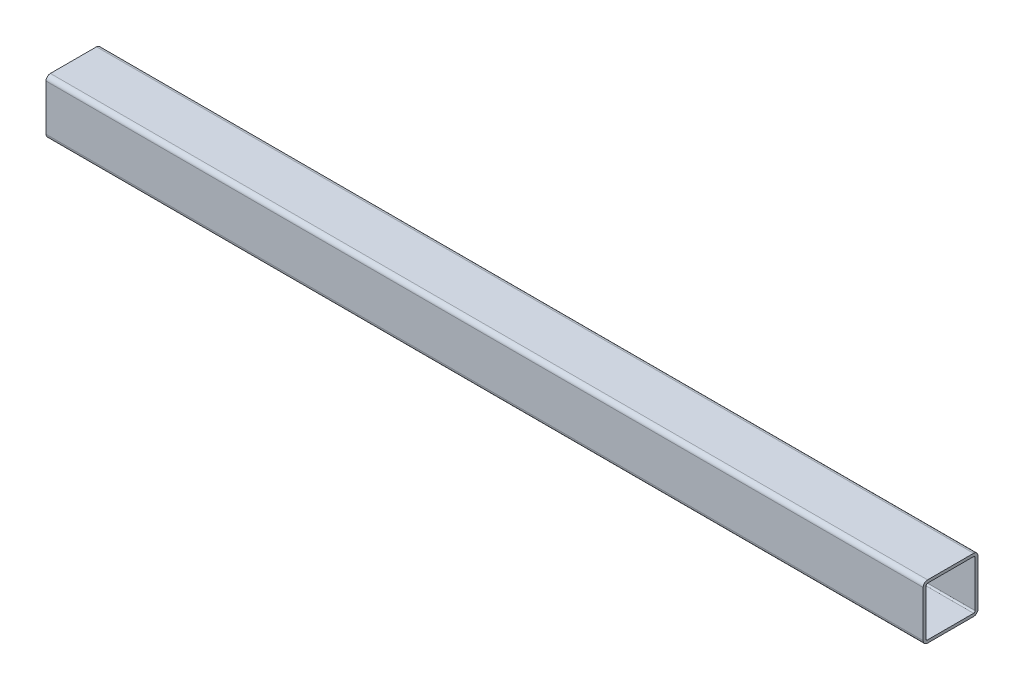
ISO-10303-21;
HEADER;
FILE_DESCRIPTION(('STEP AP214'),'2;1');
FILE_NAME('part.step','',(''),(''),'','','');
FILE_SCHEMA(('AUTOMOTIVE_DESIGN { 1 0 10303 214 1 1 1 1 }'));
ENDSEC;
DATA;
#1=APPLICATION_CONTEXT('core data for automotive mechanical design processes');
#2=APPLICATION_PROTOCOL_DEFINITION('international standard','automotive_design',2000,#1);
#3=PRODUCT_CONTEXT('',#1,'mechanical');
#4=PRODUCT('Part','Part','',(#3));
#5=PRODUCT_RELATED_PRODUCT_CATEGORY('part','',(#4));
#6=PRODUCT_DEFINITION_FORMATION('','',#4);
#7=PRODUCT_DEFINITION_CONTEXT('part definition',#1,'design');
#8=PRODUCT_DEFINITION('design','',#6,#7);
#9=PRODUCT_DEFINITION_SHAPE('','',#8);
#10=(LENGTH_UNIT() NAMED_UNIT(*) SI_UNIT(.MILLI.,.METRE.));
#11=(NAMED_UNIT(*) PLANE_ANGLE_UNIT() SI_UNIT($,.RADIAN.));
#12=(NAMED_UNIT(*) SI_UNIT($,.STERADIAN.) SOLID_ANGLE_UNIT());
#13=UNCERTAINTY_MEASURE_WITH_UNIT(LENGTH_MEASURE(1.E-05),#10,'distance_accuracy_value','');
#14=(GEOMETRIC_REPRESENTATION_CONTEXT(3) GLOBAL_UNCERTAINTY_ASSIGNED_CONTEXT((#13)) GLOBAL_UNIT_ASSIGNED_CONTEXT((#10,
#11,#12)) REPRESENTATION_CONTEXT('',''));
#15=CARTESIAN_POINT('',(0.,0.,0.));
#16=DIRECTION('',(0.,0.,1.));
#17=DIRECTION('',(1.,0.,0.));
#18=AXIS2_PLACEMENT_3D('',#15,#16,#17);
#19=CARTESIAN_POINT('',(203.2,10.541,21.209));
#20=DIRECTION('',(1.,0.,0.));
#21=DIRECTION('',(0.,0.,-1.));
#22=AXIS2_PLACEMENT_3D('',#19,#20,#21);
#23=PLANE('',#22);
#24=CARTESIAN_POINT('',(203.2,10.541,21.209));
#25=DIRECTION('',(1.,0.,0.));
#26=DIRECTION('',(0.,0.,-1.));
#27=AXIS2_PLACEMENT_3D('',#24,#25,#26);
#28=CIRCLE('',#27,1.01599999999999);
#29=CARTESIAN_POINT('',(203.2,10.541,22.225));
#30=VERTEX_POINT('',#29);
#31=CARTESIAN_POINT('',(203.2,9.525,21.209));
#32=VERTEX_POINT('',#31);
#33=EDGE_CURVE('E260',#30,#32,#28,.T.);
#34=ORIENTED_EDGE('',*,*,#33,.T.);
#35=DIRECTION('',(0.,0.,-1.));
#36=VECTOR('',#35,1.);
#37=CARTESIAN_POINT('',(203.2,9.525,21.209));
#38=LINE('',#37,#36);
#39=CARTESIAN_POINT('',(203.2,9.525,10.541));
#40=VERTEX_POINT('',#39);
#41=EDGE_CURVE('E474',#32,#40,#38,.T.);
#42=ORIENTED_EDGE('',*,*,#41,.T.);
#43=CARTESIAN_POINT('',(203.2,10.541,10.541));
#44=DIRECTION('',(1.,0.,0.));
#45=DIRECTION('',(0.,0.,-1.));
#46=AXIS2_PLACEMENT_3D('',#43,#44,#45);
#47=CIRCLE('',#46,1.016);
#48=CARTESIAN_POINT('',(203.2,10.541,9.52499999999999));
#49=VERTEX_POINT('',#48);
#50=EDGE_CURVE('E161',#40,#49,#47,.T.);
#51=ORIENTED_EDGE('',*,*,#50,.T.);
#52=DIRECTION('',(0.,1.,0.));
#53=VECTOR('',#52,1.);
#54=CARTESIAN_POINT('',(203.2,10.541,9.52499999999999));
#55=LINE('',#54,#53);
#56=CARTESIAN_POINT('',(203.2,21.209,9.52499999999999));
#57=VERTEX_POINT('',#56);
#58=EDGE_CURVE('E460',#49,#57,#55,.T.);
#59=ORIENTED_EDGE('',*,*,#58,.T.);
#60=CARTESIAN_POINT('',(203.2,21.209,10.541));
#61=DIRECTION('',(1.,0.,0.));
#62=DIRECTION('',(0.,0.,-1.));
#63=AXIS2_PLACEMENT_3D('',#60,#61,#62);
#64=CIRCLE('',#63,1.016);
#65=CARTESIAN_POINT('',(203.2,22.225,10.541));
#66=VERTEX_POINT('',#65);
#67=EDGE_CURVE('E469',#57,#66,#64,.T.);
#68=ORIENTED_EDGE('',*,*,#67,.T.);
#69=DIRECTION('',(0.,0.,1.));
#70=VECTOR('',#69,1.);
#71=CARTESIAN_POINT('',(203.2,22.225,10.541));
#72=LINE('',#71,#70);
#73=CARTESIAN_POINT('',(203.2,22.225,21.209));
#74=VERTEX_POINT('',#73);
#75=EDGE_CURVE('E276',#66,#74,#72,.T.);
#76=ORIENTED_EDGE('',*,*,#75,.T.);
#77=CARTESIAN_POINT('',(203.2,21.209,21.209));
#78=DIRECTION('',(1.,0.,0.));
#79=DIRECTION('',(0.,0.,-1.));
#80=AXIS2_PLACEMENT_3D('',#77,#78,#79);
#81=CIRCLE('',#80,1.016);
#82=CARTESIAN_POINT('',(203.2,21.209,22.225));
#83=VERTEX_POINT('',#82);
#84=EDGE_CURVE('E293',#74,#83,#81,.T.);
#85=ORIENTED_EDGE('',*,*,#84,.T.);
#86=DIRECTION('',(0.,-1.,0.));
#87=VECTOR('',#86,1.);
#88=CARTESIAN_POINT('',(203.2,21.209,22.225));
#89=LINE('',#88,#87);
#90=EDGE_CURVE('E257',#83,#30,#89,.T.);
#91=ORIENTED_EDGE('',*,*,#90,.T.);
#92=EDGE_LOOP('',(#34,#42,#51,#59,#68,#76,#85,#91));
#93=FACE_BOUND('',#92,.T.);
#94=DIRECTION('',(0.,1.,0.));
#95=VECTOR('',#94,1.);
#96=CARTESIAN_POINT('',(203.2,10.541,10.1854));
#97=LINE('',#96,#95);
#98=CARTESIAN_POINT('',(203.2,10.541,10.1854));
#99=VERTEX_POINT('',#98);
#100=CARTESIAN_POINT('',(203.2,21.209,10.1854));
#101=VERTEX_POINT('',#100);
#102=EDGE_CURVE('E253',#99,#101,#97,.T.);
#103=ORIENTED_EDGE('',*,*,#102,.F.);
#104=CARTESIAN_POINT('',(203.2,10.541,10.541));
#105=DIRECTION('',(1.,0.,0.));
#106=DIRECTION('',(0.,0.,-1.));
#107=AXIS2_PLACEMENT_3D('',#104,#105,#106);
#108=CIRCLE('',#107,0.355599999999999);
#109=CARTESIAN_POINT('',(203.2,10.1854,10.541));
#110=VERTEX_POINT('',#109);
#111=EDGE_CURVE('E100',#110,#99,#108,.T.);
#112=ORIENTED_EDGE('',*,*,#111,.F.);
#113=DIRECTION('',(0.,0.,-1.));
#114=VECTOR('',#113,1.);
#115=CARTESIAN_POINT('',(203.2,10.1854,21.209));
#116=LINE('',#115,#114);
#117=CARTESIAN_POINT('',(203.2,10.1854,21.209));
#118=VERTEX_POINT('',#117);
#119=EDGE_CURVE('E212',#118,#110,#116,.T.);
#120=ORIENTED_EDGE('',*,*,#119,.F.);
#121=CARTESIAN_POINT('',(203.2,10.541,21.209));
#122=DIRECTION('',(1.,1.3324446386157E-13,-1.33244463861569E-13));
#123=DIRECTION('',(-1.3324446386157E-13,1.,0.));
#124=AXIS2_PLACEMENT_3D('',#121,#122,#123);
#125=CIRCLE('',#124,0.355600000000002);
#126=CARTESIAN_POINT('',(203.2,10.541,21.5646));
#127=VERTEX_POINT('',#126);
#128=EDGE_CURVE('E243',#127,#118,#125,.T.);
#129=ORIENTED_EDGE('',*,*,#128,.F.);
#130=DIRECTION('',(0.,-1.,0.));
#131=VECTOR('',#130,1.);
#132=CARTESIAN_POINT('',(203.2,21.209,21.5646));
#133=LINE('',#132,#131);
#134=CARTESIAN_POINT('',(203.2,21.209,21.5646));
#135=VERTEX_POINT('',#134);
#136=EDGE_CURVE('E229',#135,#127,#133,.T.);
#137=ORIENTED_EDGE('',*,*,#136,.F.);
#138=CARTESIAN_POINT('',(203.2,21.209,21.209));
#139=DIRECTION('',(1.,0.,0.));
#140=DIRECTION('',(0.,0.,-1.));
#141=AXIS2_PLACEMENT_3D('',#138,#139,#140);
#142=CIRCLE('',#141,0.355600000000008);
#143=CARTESIAN_POINT('',(203.2,21.5646,21.209));
#144=VERTEX_POINT('',#143);
#145=EDGE_CURVE('E238',#144,#135,#142,.T.);
#146=ORIENTED_EDGE('',*,*,#145,.F.);
#147=DIRECTION('',(0.,0.,1.));
#148=VECTOR('',#147,1.);
#149=CARTESIAN_POINT('',(203.2,21.5646,10.541));
#150=LINE('',#149,#148);
#151=CARTESIAN_POINT('',(203.2,21.5646,10.541));
#152=VERTEX_POINT('',#151);
#153=EDGE_CURVE('E246',#152,#144,#150,.T.);
#154=ORIENTED_EDGE('',*,*,#153,.F.);
#155=CARTESIAN_POINT('',(203.2,21.209,10.541));
#156=DIRECTION('',(1.,1.33244463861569E-13,-1.33244463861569E-13));
#157=DIRECTION('',(-1.33244463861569E-13,0.,-1.));
#158=AXIS2_PLACEMENT_3D('',#155,#156,#157);
#159=CIRCLE('',#158,0.355599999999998);
#160=EDGE_CURVE('E251',#101,#152,#159,.T.);
#161=ORIENTED_EDGE('',*,*,#160,.F.);
#162=EDGE_LOOP('',(#103,#112,#120,#129,#137,#146,#154,#161));
#163=FACE_BOUND('',#162,.T.);
#164=ADVANCED_FACE('F41',(#93,#163),#23,.T.);
#165=CARTESIAN_POINT('',(0.,10.541,21.209));
#166=DIRECTION('',(1.,0.,0.));
#167=DIRECTION('',(0.,0.,-1.));
#168=AXIS2_PLACEMENT_3D('',#165,#166,#167);
#169=PLANE('',#168);
#170=CARTESIAN_POINT('',(0.,10.541,21.209));
#171=DIRECTION('',(1.,0.,0.));
#172=DIRECTION('',(0.,0.,-1.));
#173=AXIS2_PLACEMENT_3D('',#170,#171,#172);
#174=CIRCLE('',#173,1.01599999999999);
#175=CARTESIAN_POINT('',(0.,10.541,22.225));
#176=VERTEX_POINT('',#175);
#177=CARTESIAN_POINT('',(0.,9.525,21.209));
#178=VERTEX_POINT('',#177);
#179=EDGE_CURVE('E154',#176,#178,#174,.T.);
#180=ORIENTED_EDGE('',*,*,#179,.F.);
#181=DIRECTION('',(0.,-1.,0.));
#182=VECTOR('',#181,1.);
#183=CARTESIAN_POINT('',(0.,21.209,22.225));
#184=LINE('',#183,#182);
#185=CARTESIAN_POINT('',(0.,21.209,22.225));
#186=VERTEX_POINT('',#185);
#187=EDGE_CURVE('E258',#186,#176,#184,.T.);
#188=ORIENTED_EDGE('',*,*,#187,.F.);
#189=CARTESIAN_POINT('',(0.,21.209,21.209));
#190=DIRECTION('',(1.,0.,0.));
#191=DIRECTION('',(0.,0.,-1.));
#192=AXIS2_PLACEMENT_3D('',#189,#190,#191);
#193=CIRCLE('',#192,1.016);
#194=CARTESIAN_POINT('',(0.,22.225,21.209));
#195=VERTEX_POINT('',#194);
#196=EDGE_CURVE('E261',#195,#186,#193,.T.);
#197=ORIENTED_EDGE('',*,*,#196,.F.);
#198=DIRECTION('',(0.,0.,1.));
#199=VECTOR('',#198,1.);
#200=CARTESIAN_POINT('',(0.,22.225,10.541));
#201=LINE('',#200,#199);
#202=CARTESIAN_POINT('',(0.,22.225,10.541));
#203=VERTEX_POINT('',#202);
#204=EDGE_CURVE('E263',#203,#195,#201,.T.);
#205=ORIENTED_EDGE('',*,*,#204,.F.);
#206=CARTESIAN_POINT('',(0.,21.209,10.541));
#207=DIRECTION('',(1.,0.,0.));
#208=DIRECTION('',(0.,0.,-1.));
#209=AXIS2_PLACEMENT_3D('',#206,#207,#208);
#210=CIRCLE('',#209,1.016);
#211=CARTESIAN_POINT('',(0.,21.209,9.52499999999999));
#212=VERTEX_POINT('',#211);
#213=EDGE_CURVE('E170',#212,#203,#210,.T.);
#214=ORIENTED_EDGE('',*,*,#213,.F.);
#215=DIRECTION('',(0.,1.,0.));
#216=VECTOR('',#215,1.);
#217=CARTESIAN_POINT('',(0.,10.541,9.52499999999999));
#218=LINE('',#217,#216);
#219=CARTESIAN_POINT('',(0.,10.541,9.52499999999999));
#220=VERTEX_POINT('',#219);
#221=EDGE_CURVE('E168',#220,#212,#218,.T.);
#222=ORIENTED_EDGE('',*,*,#221,.F.);
#223=CARTESIAN_POINT('',(0.,10.541,10.541));
#224=DIRECTION('',(1.,0.,0.));
#225=DIRECTION('',(0.,0.,-1.));
#226=AXIS2_PLACEMENT_3D('',#223,#224,#225);
#227=CIRCLE('',#226,1.016);
#228=CARTESIAN_POINT('',(0.,9.525,10.541));
#229=VERTEX_POINT('',#228);
#230=EDGE_CURVE('E153',#229,#220,#227,.T.);
#231=ORIENTED_EDGE('',*,*,#230,.F.);
#232=DIRECTION('',(0.,0.,-1.));
#233=VECTOR('',#232,1.);
#234=CARTESIAN_POINT('',(0.,9.525,21.209));
#235=LINE('',#234,#233);
#236=EDGE_CURVE('E143',#178,#229,#235,.T.);
#237=ORIENTED_EDGE('',*,*,#236,.F.);
#238=EDGE_LOOP('',(#180,#188,#197,#205,#214,#222,#231,#237));
#239=FACE_BOUND('',#238,.T.);
#240=CARTESIAN_POINT('',(0.,10.541,10.541));
#241=DIRECTION('',(1.,0.,0.));
#242=DIRECTION('',(0.,0.,-1.));
#243=AXIS2_PLACEMENT_3D('',#240,#241,#242);
#244=CIRCLE('',#243,0.355599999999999);
#245=CARTESIAN_POINT('',(0.,10.1854,10.541));
#246=VERTEX_POINT('',#245);
#247=CARTESIAN_POINT('',(0.,10.541,10.1854));
#248=VERTEX_POINT('',#247);
#249=EDGE_CURVE('E66',#246,#248,#244,.T.);
#250=ORIENTED_EDGE('',*,*,#249,.T.);
#251=DIRECTION('',(0.,1.,0.));
#252=VECTOR('',#251,1.);
#253=CARTESIAN_POINT('',(0.,10.541,10.1854));
#254=LINE('',#253,#252);
#255=CARTESIAN_POINT('',(0.,21.209,10.1854));
#256=VERTEX_POINT('',#255);
#257=EDGE_CURVE('E175',#248,#256,#254,.T.);
#258=ORIENTED_EDGE('',*,*,#257,.T.);
#259=CARTESIAN_POINT('',(0.,21.209,10.541));
#260=DIRECTION('',(1.,0.,0.));
#261=DIRECTION('',(0.,0.,-1.));
#262=AXIS2_PLACEMENT_3D('',#259,#260,#261);
#263=CIRCLE('',#262,0.355599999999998);
#264=CARTESIAN_POINT('',(0.,21.5646,10.541));
#265=VERTEX_POINT('',#264);
#266=EDGE_CURVE('E178',#256,#265,#263,.T.);
#267=ORIENTED_EDGE('',*,*,#266,.T.);
#268=DIRECTION('',(0.,0.,1.));
#269=VECTOR('',#268,1.);
#270=CARTESIAN_POINT('',(0.,21.5646,10.541));
#271=LINE('',#270,#269);
#272=CARTESIAN_POINT('',(0.,21.5646,21.209));
#273=VERTEX_POINT('',#272);
#274=EDGE_CURVE('E181',#265,#273,#271,.T.);
#275=ORIENTED_EDGE('',*,*,#274,.T.);
#276=CARTESIAN_POINT('',(0.,21.209,21.209));
#277=DIRECTION('',(1.,0.,0.));
#278=DIRECTION('',(0.,0.,-1.));
#279=AXIS2_PLACEMENT_3D('',#276,#277,#278);
#280=CIRCLE('',#279,0.355600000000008);
#281=CARTESIAN_POINT('',(0.,21.209,21.5646));
#282=VERTEX_POINT('',#281);
#283=EDGE_CURVE('E184',#273,#282,#280,.T.);
#284=ORIENTED_EDGE('',*,*,#283,.T.);
#285=DIRECTION('',(0.,-1.,0.));
#286=VECTOR('',#285,1.);
#287=CARTESIAN_POINT('',(0.,21.209,21.5646));
#288=LINE('',#287,#286);
#289=CARTESIAN_POINT('',(0.,10.541,21.5646));
#290=VERTEX_POINT('',#289);
#291=EDGE_CURVE('E187',#282,#290,#288,.T.);
#292=ORIENTED_EDGE('',*,*,#291,.T.);
#293=CARTESIAN_POINT('',(0.,10.541,21.209));
#294=DIRECTION('',(1.,0.,0.));
#295=DIRECTION('',(0.,0.,-1.));
#296=AXIS2_PLACEMENT_3D('',#293,#294,#295);
#297=CIRCLE('',#296,0.355600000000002);
#298=CARTESIAN_POINT('',(0.,10.1854,21.209));
#299=VERTEX_POINT('',#298);
#300=EDGE_CURVE('E190',#290,#299,#297,.T.);
#301=ORIENTED_EDGE('',*,*,#300,.T.);
#302=DIRECTION('',(0.,0.,-1.));
#303=VECTOR('',#302,1.);
#304=CARTESIAN_POINT('',(0.,10.1854,21.209));
#305=LINE('',#304,#303);
#306=EDGE_CURVE('E193',#299,#246,#305,.T.);
#307=ORIENTED_EDGE('',*,*,#306,.T.);
#308=EDGE_LOOP('',(#250,#258,#267,#275,#284,#292,#301,#307));
#309=FACE_BOUND('',#308,.T.);
#310=ADVANCED_FACE('F165',(#239,#309),#169,.F.);
#311=CARTESIAN_POINT('',(203.2,10.541,21.209));
#312=DIRECTION('',(-1.,0.,0.));
#313=DIRECTION('',(0.,0.,1.));
#314=AXIS2_PLACEMENT_3D('',#311,#312,#313);
#315=CYLINDRICAL_SURFACE('',#314,1.016);
#316=ORIENTED_EDGE('',*,*,#179,.T.);
#317=DIRECTION('',(-1.,0.,0.));
#318=VECTOR('',#317,1.);
#319=CARTESIAN_POINT('',(203.2,9.525,21.209));
#320=LINE('',#319,#318);
#321=EDGE_CURVE('E11',#32,#178,#320,.T.);
#322=ORIENTED_EDGE('',*,*,#321,.F.);
#323=ORIENTED_EDGE('',*,*,#33,.F.);
#324=DIRECTION('',(-1.,0.,0.));
#325=VECTOR('',#324,1.);
#326=CARTESIAN_POINT('',(203.2,10.541,22.225));
#327=LINE('',#326,#325);
#328=EDGE_CURVE('E209',#30,#176,#327,.T.);
#329=ORIENTED_EDGE('',*,*,#328,.T.);
#330=EDGE_LOOP('',(#316,#322,#323,#329));
#331=FACE_BOUND('',#330,.T.);
#332=ADVANCED_FACE('F323',(#331),#315,.T.);
#333=CARTESIAN_POINT('',(203.2,9.525,21.209));
#334=DIRECTION('',(0.,1.,0.));
#335=DIRECTION('',(0.,0.,1.));
#336=AXIS2_PLACEMENT_3D('',#333,#334,#335);
#337=PLANE('',#336);
#338=ORIENTED_EDGE('',*,*,#236,.T.);
#339=DIRECTION('',(-1.,0.,0.));
#340=VECTOR('',#339,1.);
#341=CARTESIAN_POINT('',(203.2,9.525,10.541));
#342=LINE('',#341,#340);
#343=EDGE_CURVE('E50',#40,#229,#342,.T.);
#344=ORIENTED_EDGE('',*,*,#343,.F.);
#345=ORIENTED_EDGE('',*,*,#41,.F.);
#346=ORIENTED_EDGE('',*,*,#321,.T.);
#347=EDGE_LOOP('',(#338,#344,#345,#346));
#348=FACE_BOUND('',#347,.T.);
#349=ADVANCED_FACE('F147',(#348),#337,.F.);
#350=CARTESIAN_POINT('',(203.2,10.541,10.541));
#351=DIRECTION('',(-1.,0.,0.));
#352=DIRECTION('',(0.,0.,1.));
#353=AXIS2_PLACEMENT_3D('',#350,#351,#352);
#354=CYLINDRICAL_SURFACE('',#353,1.016);
#355=ORIENTED_EDGE('',*,*,#230,.T.);
#356=DIRECTION('',(-1.,0.,0.));
#357=VECTOR('',#356,1.);
#358=CARTESIAN_POINT('',(203.2,10.541,9.52499999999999));
#359=LINE('',#358,#357);
#360=EDGE_CURVE('E162',#49,#220,#359,.T.);
#361=ORIENTED_EDGE('',*,*,#360,.F.);
#362=ORIENTED_EDGE('',*,*,#50,.F.);
#363=ORIENTED_EDGE('',*,*,#343,.T.);
#364=EDGE_LOOP('',(#355,#361,#362,#363));
#365=FACE_BOUND('',#364,.T.);
#366=ADVANCED_FACE('F157',(#365),#354,.T.);
#367=CARTESIAN_POINT('',(203.2,10.541,9.52499999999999));
#368=DIRECTION('',(0.,0.,1.));
#369=DIRECTION('',(1.,0.,0.));
#370=AXIS2_PLACEMENT_3D('',#367,#368,#369);
#371=PLANE('',#370);
#372=ORIENTED_EDGE('',*,*,#221,.T.);
#373=DIRECTION('',(-1.,0.,0.));
#374=VECTOR('',#373,1.);
#375=CARTESIAN_POINT('',(203.2,21.209,9.52499999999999));
#376=LINE('',#375,#374);
#377=EDGE_CURVE('E197',#57,#212,#376,.T.);
#378=ORIENTED_EDGE('',*,*,#377,.F.);
#379=ORIENTED_EDGE('',*,*,#58,.F.);
#380=ORIENTED_EDGE('',*,*,#360,.T.);
#381=EDGE_LOOP('',(#372,#378,#379,#380));
#382=FACE_BOUND('',#381,.T.);
#383=ADVANCED_FACE('F333',(#382),#371,.F.);
#384=CARTESIAN_POINT('',(203.2,21.209,10.541));
#385=DIRECTION('',(-1.,0.,0.));
#386=DIRECTION('',(0.,0.,1.));
#387=AXIS2_PLACEMENT_3D('',#384,#385,#386);
#388=CYLINDRICAL_SURFACE('',#387,1.016);
#389=ORIENTED_EDGE('',*,*,#213,.T.);
#390=DIRECTION('',(-1.,0.,0.));
#391=VECTOR('',#390,1.);
#392=CARTESIAN_POINT('',(203.2,22.225,10.541));
#393=LINE('',#392,#391);
#394=EDGE_CURVE('E200',#66,#203,#393,.T.);
#395=ORIENTED_EDGE('',*,*,#394,.F.);
#396=ORIENTED_EDGE('',*,*,#67,.F.);
#397=ORIENTED_EDGE('',*,*,#377,.T.);
#398=EDGE_LOOP('',(#389,#395,#396,#397));
#399=FACE_BOUND('',#398,.T.);
#400=ADVANCED_FACE('F266',(#399),#388,.T.);
#401=CARTESIAN_POINT('',(203.2,22.225,10.541));
#402=DIRECTION('',(0.,-1.,0.));
#403=DIRECTION('',(0.,0.,-1.));
#404=AXIS2_PLACEMENT_3D('',#401,#402,#403);
#405=PLANE('',#404);
#406=ORIENTED_EDGE('',*,*,#204,.T.);
#407=DIRECTION('',(-1.,0.,0.));
#408=VECTOR('',#407,1.);
#409=CARTESIAN_POINT('',(203.2,22.225,21.209));
#410=LINE('',#409,#408);
#411=EDGE_CURVE('E203',#74,#195,#410,.T.);
#412=ORIENTED_EDGE('',*,*,#411,.F.);
#413=ORIENTED_EDGE('',*,*,#75,.F.);
#414=ORIENTED_EDGE('',*,*,#394,.T.);
#415=EDGE_LOOP('',(#406,#412,#413,#414));
#416=FACE_BOUND('',#415,.T.);
#417=ADVANCED_FACE('F273',(#416),#405,.F.);
#418=CARTESIAN_POINT('',(203.2,21.209,21.209));
#419=DIRECTION('',(-1.,0.,0.));
#420=DIRECTION('',(0.,0.,1.));
#421=AXIS2_PLACEMENT_3D('',#418,#419,#420);
#422=CYLINDRICAL_SURFACE('',#421,1.016);
#423=ORIENTED_EDGE('',*,*,#196,.T.);
#424=DIRECTION('',(-1.,0.,0.));
#425=VECTOR('',#424,1.);
#426=CARTESIAN_POINT('',(203.2,21.209,22.225));
#427=LINE('',#426,#425);
#428=EDGE_CURVE('E206',#83,#186,#427,.T.);
#429=ORIENTED_EDGE('',*,*,#428,.F.);
#430=ORIENTED_EDGE('',*,*,#84,.F.);
#431=ORIENTED_EDGE('',*,*,#411,.T.);
#432=EDGE_LOOP('',(#423,#429,#430,#431));
#433=FACE_BOUND('',#432,.T.);
#434=ADVANCED_FACE('F281',(#433),#422,.T.);
#435=CARTESIAN_POINT('',(203.2,21.209,22.225));
#436=DIRECTION('',(0.,0.,-1.));
#437=DIRECTION('',(0.,1.,0.));
#438=AXIS2_PLACEMENT_3D('',#435,#436,#437);
#439=PLANE('',#438);
#440=ORIENTED_EDGE('',*,*,#187,.T.);
#441=ORIENTED_EDGE('',*,*,#328,.F.);
#442=ORIENTED_EDGE('',*,*,#90,.F.);
#443=ORIENTED_EDGE('',*,*,#428,.T.);
#444=EDGE_LOOP('',(#440,#441,#442,#443));
#445=FACE_BOUND('',#444,.T.);
#446=ADVANCED_FACE('F285',(#445),#439,.F.);
#447=CARTESIAN_POINT('',(203.2,10.541,10.541));
#448=DIRECTION('',(-1.,0.,0.));
#449=DIRECTION('',(0.,0.,1.));
#450=AXIS2_PLACEMENT_3D('',#447,#448,#449);
#451=CYLINDRICAL_SURFACE('',#450,0.3556);
#452=ORIENTED_EDGE('',*,*,#249,.F.);
#453=DIRECTION('',(-1.,0.,0.));
#454=VECTOR('',#453,1.);
#455=CARTESIAN_POINT('',(203.2,10.1854,10.541));
#456=LINE('',#455,#454);
#457=EDGE_CURVE('E210',#110,#246,#456,.T.);
#458=ORIENTED_EDGE('',*,*,#457,.F.);
#459=ORIENTED_EDGE('',*,*,#111,.T.);
#460=DIRECTION('',(-1.,0.,0.));
#461=VECTOR('',#460,1.);
#462=CARTESIAN_POINT('',(203.2,10.541,10.1854));
#463=LINE('',#462,#461);
#464=EDGE_CURVE('E213',#99,#248,#463,.T.);
#465=ORIENTED_EDGE('',*,*,#464,.T.);
#466=EDGE_LOOP('',(#452,#458,#459,#465));
#467=FACE_BOUND('',#466,.T.);
#468=ADVANCED_FACE('F299',(#467),#451,.F.);
#469=CARTESIAN_POINT('',(203.2,10.541,10.1854));
#470=DIRECTION('',(0.,0.,1.));
#471=DIRECTION('',(1.,0.,0.));
#472=AXIS2_PLACEMENT_3D('',#469,#470,#471);
#473=PLANE('',#472);
#474=ORIENTED_EDGE('',*,*,#257,.F.);
#475=ORIENTED_EDGE('',*,*,#464,.F.);
#476=ORIENTED_EDGE('',*,*,#102,.T.);
#477=DIRECTION('',(-1.,0.,0.));
#478=VECTOR('',#477,1.);
#479=CARTESIAN_POINT('',(203.2,21.209,10.1854));
#480=LINE('',#479,#478);
#481=EDGE_CURVE('E215',#101,#256,#480,.T.);
#482=ORIENTED_EDGE('',*,*,#481,.T.);
#483=EDGE_LOOP('',(#474,#475,#476,#482));
#484=FACE_BOUND('',#483,.T.);
#485=ADVANCED_FACE('F303',(#484),#473,.T.);
#486=CARTESIAN_POINT('',(203.2,21.209,10.541));
#487=DIRECTION('',(-1.,0.,0.));
#488=DIRECTION('',(0.,0.,1.));
#489=AXIS2_PLACEMENT_3D('',#486,#487,#488);
#490=CYLINDRICAL_SURFACE('',#489,0.3556);
#491=ORIENTED_EDGE('',*,*,#266,.F.);
#492=ORIENTED_EDGE('',*,*,#481,.F.);
#493=ORIENTED_EDGE('',*,*,#160,.T.);
#494=DIRECTION('',(-1.,0.,0.));
#495=VECTOR('',#494,1.);
#496=CARTESIAN_POINT('',(203.2,21.5646,10.541));
#497=LINE('',#496,#495);
#498=EDGE_CURVE('E217',#152,#265,#497,.T.);
#499=ORIENTED_EDGE('',*,*,#498,.T.);
#500=EDGE_LOOP('',(#491,#492,#493,#499));
#501=FACE_BOUND('',#500,.T.);
#502=ADVANCED_FACE('F306',(#501),#490,.F.);
#503=CARTESIAN_POINT('',(203.2,21.5646,10.541));
#504=DIRECTION('',(0.,-1.,0.));
#505=DIRECTION('',(0.,0.,-1.));
#506=AXIS2_PLACEMENT_3D('',#503,#504,#505);
#507=PLANE('',#506);
#508=ORIENTED_EDGE('',*,*,#274,.F.);
#509=ORIENTED_EDGE('',*,*,#498,.F.);
#510=ORIENTED_EDGE('',*,*,#153,.T.);
#511=DIRECTION('',(-1.,0.,0.));
#512=VECTOR('',#511,1.);
#513=CARTESIAN_POINT('',(203.2,21.5646,21.209));
#514=LINE('',#513,#512);
#515=EDGE_CURVE('E219',#144,#273,#514,.T.);
#516=ORIENTED_EDGE('',*,*,#515,.T.);
#517=EDGE_LOOP('',(#508,#509,#510,#516));
#518=FACE_BOUND('',#517,.T.);
#519=ADVANCED_FACE('F309',(#518),#507,.T.);
#520=CARTESIAN_POINT('',(203.2,21.209,21.209));
#521=DIRECTION('',(-1.,0.,0.));
#522=DIRECTION('',(0.,0.,1.));
#523=AXIS2_PLACEMENT_3D('',#520,#521,#522);
#524=CYLINDRICAL_SURFACE('',#523,0.355600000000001);
#525=ORIENTED_EDGE('',*,*,#283,.F.);
#526=ORIENTED_EDGE('',*,*,#515,.F.);
#527=ORIENTED_EDGE('',*,*,#145,.T.);
#528=DIRECTION('',(-1.,0.,0.));
#529=VECTOR('',#528,1.);
#530=CARTESIAN_POINT('',(203.2,21.209,21.5646));
#531=LINE('',#530,#529);
#532=EDGE_CURVE('E221',#135,#282,#531,.T.);
#533=ORIENTED_EDGE('',*,*,#532,.T.);
#534=EDGE_LOOP('',(#525,#526,#527,#533));
#535=FACE_BOUND('',#534,.T.);
#536=ADVANCED_FACE('F236',(#535),#524,.F.);
#537=CARTESIAN_POINT('',(203.2,21.209,21.5646));
#538=DIRECTION('',(0.,0.,-1.));
#539=DIRECTION('',(-1.,0.,0.));
#540=AXIS2_PLACEMENT_3D('',#537,#538,#539);
#541=PLANE('',#540);
#542=ORIENTED_EDGE('',*,*,#291,.F.);
#543=ORIENTED_EDGE('',*,*,#532,.F.);
#544=ORIENTED_EDGE('',*,*,#136,.T.);
#545=DIRECTION('',(-1.,0.,0.));
#546=VECTOR('',#545,1.);
#547=CARTESIAN_POINT('',(203.2,10.541,21.5646));
#548=LINE('',#547,#546);
#549=EDGE_CURVE('E222',#127,#290,#548,.T.);
#550=ORIENTED_EDGE('',*,*,#549,.T.);
#551=EDGE_LOOP('',(#542,#543,#544,#550));
#552=FACE_BOUND('',#551,.T.);
#553=ADVANCED_FACE('F226',(#552),#541,.T.);
#554=CARTESIAN_POINT('',(203.2,10.541,21.209));
#555=DIRECTION('',(-1.,0.,0.));
#556=DIRECTION('',(0.,0.,1.));
#557=AXIS2_PLACEMENT_3D('',#554,#555,#556);
#558=CYLINDRICAL_SURFACE('',#557,0.355600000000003);
#559=ORIENTED_EDGE('',*,*,#300,.F.);
#560=ORIENTED_EDGE('',*,*,#549,.F.);
#561=ORIENTED_EDGE('',*,*,#128,.T.);
#562=DIRECTION('',(-1.,0.,0.));
#563=VECTOR('',#562,1.);
#564=CARTESIAN_POINT('',(203.2,10.1854,21.209));
#565=LINE('',#564,#563);
#566=EDGE_CURVE('E45',#118,#299,#565,.T.);
#567=ORIENTED_EDGE('',*,*,#566,.T.);
#568=EDGE_LOOP('',(#559,#560,#561,#567));
#569=FACE_BOUND('',#568,.T.);
#570=ADVANCED_FACE('F231',(#569),#558,.F.);
#571=CARTESIAN_POINT('',(203.2,10.1854,21.209));
#572=DIRECTION('',(0.,1.,0.));
#573=DIRECTION('',(0.,0.,1.));
#574=AXIS2_PLACEMENT_3D('',#571,#572,#573);
#575=PLANE('',#574);
#576=ORIENTED_EDGE('',*,*,#306,.F.);
#577=ORIENTED_EDGE('',*,*,#566,.F.);
#578=ORIENTED_EDGE('',*,*,#119,.T.);
#579=ORIENTED_EDGE('',*,*,#457,.T.);
#580=EDGE_LOOP('',(#576,#577,#578,#579));
#581=FACE_BOUND('',#580,.T.);
#582=ADVANCED_FACE('F43',(#581),#575,.T.);
#583=CLOSED_SHELL('',(#164,#310,#332,#349,#366,#383,#400,#417,#434,#446,#468,#485,#502,#519,
#536,#553,#570,#582));
#584=MANIFOLD_SOLID_BREP('B2',#583);
#585=ADVANCED_BREP_SHAPE_REPRESENTATION('',(#18,#584),#14);
#586=SHAPE_DEFINITION_REPRESENTATION(#9,#585);
ENDSEC;
END-ISO-10303-21;
